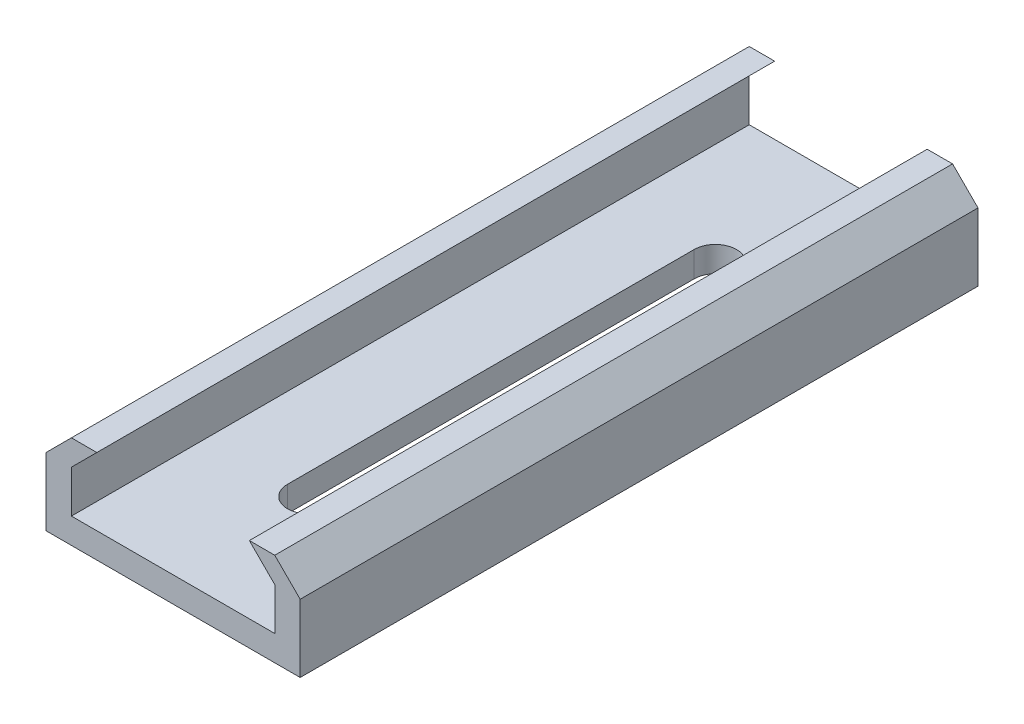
from build123d import *

# Parameters (mm, degrees)
BASE_EXTRUDE_DEPTH   = 254
SLOT_STRAIGHT1_DEPTH = 194.472971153
SKETCH3_R            = 7.874
BOSS_EXTRUDE1_DEPTH  = 9.525


with BuildPart() as part:
    # Sketch1 → Base-Extrude (new body)
    with BuildSketch(Plane.XY):
        Polygon((-47.625, 15.875), (-38.1, 25.4), (-28.575, 25.4), (-38.1, 15.875), (-38.1, 0), (38.1, 0), (38.1, 15.875), (28.575, 25.4), (38.1, 25.4), (47.625, 15.875), (47.625, -9.525), (-47.625, -9.525), align=None)
    extrude(amount=-BASE_EXTRUDE_DEPTH)

    # Sketch2 → Slot straight1 (cut, through all)
    with BuildSketch(Plane(origin=(9.014434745, -9.525, -72.329943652), x_dir=(0, 0, 1), z_dir=(0, -1, 0))):
        with BuildLine():
            Line((-130.870056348, 16.951934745), (21.529943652, 16.951934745))
            ThreePointArc((21.529943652, 16.951934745), (29.467443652, 9.014434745), (21.529943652, 1.076934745))
            Line((21.529943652, 1.076934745), (-130.870056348, 1.076934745))
            ThreePointArc((-130.870056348, 1.076934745), (-138.807556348, 9.014434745), (-130.870056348, 16.951934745))
        make_face()
    extrude(amount=-SLOT_STRAIGHT1_DEPTH, mode=Mode.SUBTRACT)

    # Sketch3 → Boss-Extrude1 (add)
    with BuildSketch(Plane.XZ.offset(9.525)):
        with Locations(Location((-25.4, -203.2, 0), (0, 0, 90))):
            Circle(SKETCH3_R)
        with Locations(Location((25.4, -203.2, 0), (0, 0, 90))):
            Circle(SKETCH3_R)
    extrude(amount=BOSS_EXTRUDE1_DEPTH)


solid = part.part
